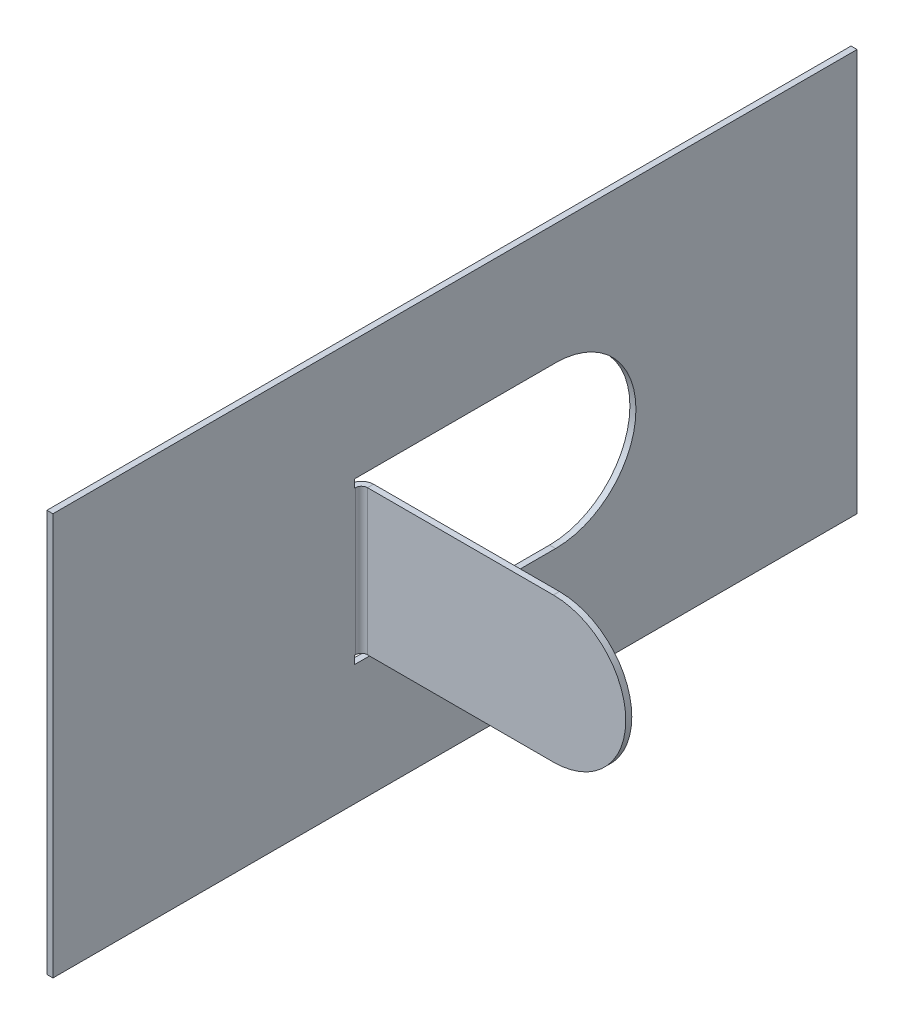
ISO-10303-21;
HEADER;
FILE_DESCRIPTION(('STEP AP214'),'2;1');
FILE_NAME('part.step','',(''),(''),'','','');
FILE_SCHEMA(('AUTOMOTIVE_DESIGN { 1 0 10303 214 1 1 1 1 }'));
ENDSEC;
DATA;
#1=APPLICATION_CONTEXT('core data for automotive mechanical design processes');
#2=APPLICATION_PROTOCOL_DEFINITION('international standard','automotive_design',2000,#1);
#3=PRODUCT_CONTEXT('',#1,'mechanical');
#4=PRODUCT('Part','Part','',(#3));
#5=PRODUCT_RELATED_PRODUCT_CATEGORY('part','',(#4));
#6=PRODUCT_DEFINITION_FORMATION('','',#4);
#7=PRODUCT_DEFINITION_CONTEXT('part definition',#1,'design');
#8=PRODUCT_DEFINITION('design','',#6,#7);
#9=PRODUCT_DEFINITION_SHAPE('','',#8);
#10=(LENGTH_UNIT() NAMED_UNIT(*) SI_UNIT(.MILLI.,.METRE.));
#11=(NAMED_UNIT(*) PLANE_ANGLE_UNIT() SI_UNIT($,.RADIAN.));
#12=(NAMED_UNIT(*) SI_UNIT($,.STERADIAN.) SOLID_ANGLE_UNIT());
#13=UNCERTAINTY_MEASURE_WITH_UNIT(LENGTH_MEASURE(1.E-05),#10,'distance_accuracy_value','');
#14=(GEOMETRIC_REPRESENTATION_CONTEXT(3) GLOBAL_UNCERTAINTY_ASSIGNED_CONTEXT((#13)) GLOBAL_UNIT_ASSIGNED_CONTEXT((#10,
#11,#12)) REPRESENTATION_CONTEXT('',''));
#15=CARTESIAN_POINT('',(0.,0.,0.));
#16=DIRECTION('',(0.,0.,1.));
#17=DIRECTION('',(1.,0.,0.));
#18=AXIS2_PLACEMENT_3D('',#15,#16,#17);
#19=CARTESIAN_POINT('',(-22.7328541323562,-50.,-123.267145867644));
#20=DIRECTION('',(1.,0.,0.));
#21=DIRECTION('',(0.,0.,-1.));
#22=AXIS2_PLACEMENT_3D('',#19,#20,#21);
#23=PLANE('',#22);
#24=DIRECTION('',(0.,1.,0.));
#25=VECTOR('',#24,1.);
#26=CARTESIAN_POINT('',(-22.7328541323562,50.,-123.267145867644));
#27=LINE('',#26,#25);
#28=CARTESIAN_POINT('',(-22.7328541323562,-50.,-123.267145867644));
#29=VERTEX_POINT('',#28);
#30=CARTESIAN_POINT('',(-22.7328541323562,50.,-123.267145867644));
#31=VERTEX_POINT('',#30);
#32=EDGE_CURVE('E247',#29,#31,#27,.T.);
#33=ORIENTED_EDGE('',*,*,#32,.T.);
#34=DIRECTION('',(0.,0.,1.));
#35=VECTOR('',#34,1.);
#36=CARTESIAN_POINT('',(-22.7328541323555,50.,76.7328541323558));
#37=LINE('',#36,#35);
#38=CARTESIAN_POINT('',(-22.7328541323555,50.,76.7328541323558));
#39=VERTEX_POINT('',#38);
#40=EDGE_CURVE('E274',#31,#39,#37,.T.);
#41=ORIENTED_EDGE('',*,*,#40,.T.);
#42=DIRECTION('',(0.,-1.,0.));
#43=VECTOR('',#42,1.);
#44=CARTESIAN_POINT('',(-22.7328541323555,50.,76.7328541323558));
#45=LINE('',#44,#43);
#46=CARTESIAN_POINT('',(-22.7328541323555,-50.,76.7328541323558));
#47=VERTEX_POINT('',#46);
#48=EDGE_CURVE('E277',#39,#47,#45,.T.);
#49=ORIENTED_EDGE('',*,*,#48,.T.);
#50=DIRECTION('',(0.,0.,-1.));
#51=VECTOR('',#50,1.);
#52=CARTESIAN_POINT('',(-22.7328541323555,-50.,76.7328541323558));
#53=LINE('',#52,#51);
#54=EDGE_CURVE('E262',#47,#29,#53,.T.);
#55=ORIENTED_EDGE('',*,*,#54,.T.);
#56=EDGE_LOOP('',(#33,#41,#49,#55));
#57=FACE_BOUND('',#56,.T.);
#58=DIRECTION('',(0.,0.,1.));
#59=VECTOR('',#58,1.);
#60=CARTESIAN_POINT('',(-22.7328541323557,-18.,1.73285413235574));
#61=LINE('',#60,#59);
#62=CARTESIAN_POINT('',(-22.7328541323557,-18.,1.5));
#63=VERTEX_POINT('',#62);
#64=CARTESIAN_POINT('',(-22.7328541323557,-18.,1.73285413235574));
#65=VERTEX_POINT('',#64);
#66=EDGE_CURVE('E58',#63,#65,#61,.T.);
#67=ORIENTED_EDGE('',*,*,#66,.F.);
#68=DIRECTION('',(0.,1.,0.));
#69=VECTOR('',#68,1.);
#70=CARTESIAN_POINT('',(-22.7328541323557,-50.,1.50000000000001));
#71=LINE('',#70,#69);
#72=CARTESIAN_POINT('',(-22.7328541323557,18.,1.5));
#73=VERTEX_POINT('',#72);
#74=EDGE_CURVE('E50',#63,#73,#71,.T.);
#75=ORIENTED_EDGE('',*,*,#74,.T.);
#76=DIRECTION('',(0.,0.,-1.));
#77=VECTOR('',#76,1.);
#78=CARTESIAN_POINT('',(-22.7328541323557,18.,1.73285413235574));
#79=LINE('',#78,#77);
#80=CARTESIAN_POINT('',(-22.7328541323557,18.,1.73285413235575));
#81=VERTEX_POINT('',#80);
#82=EDGE_CURVE('E66',#81,#73,#79,.T.);
#83=ORIENTED_EDGE('',*,*,#82,.F.);
#84=DIRECTION('',(0.,-1.,0.));
#85=VECTOR('',#84,1.);
#86=CARTESIAN_POINT('',(-22.7328541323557,20.,1.73285413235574));
#87=LINE('',#86,#85);
#88=CARTESIAN_POINT('',(-22.7328541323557,20.,1.73285413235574));
#89=VERTEX_POINT('',#88);
#90=EDGE_CURVE('E195',#89,#81,#87,.T.);
#91=ORIENTED_EDGE('',*,*,#90,.F.);
#92=DIRECTION('',(0.,0.,1.));
#93=VECTOR('',#92,1.);
#94=CARTESIAN_POINT('',(-22.7328541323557,20.,1.73285413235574));
#95=LINE('',#94,#93);
#96=CARTESIAN_POINT('',(-22.7328541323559,19.9999999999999,-48.2671458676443));
#97=VERTEX_POINT('',#96);
#98=EDGE_CURVE('E219',#97,#89,#95,.T.);
#99=ORIENTED_EDGE('',*,*,#98,.F.);
#100=CARTESIAN_POINT('',(-22.7328541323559,0.,-48.2671458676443));
#101=DIRECTION('',(1.,0.,0.));
#102=DIRECTION('',(0.,0.,-1.));
#103=AXIS2_PLACEMENT_3D('',#100,#101,#102);
#104=CIRCLE('',#103,20.);
#105=CARTESIAN_POINT('',(-22.7328541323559,-20.,-48.2671458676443));
#106=VERTEX_POINT('',#105);
#107=EDGE_CURVE('E240',#106,#97,#104,.T.);
#108=ORIENTED_EDGE('',*,*,#107,.F.);
#109=DIRECTION('',(0.,0.,-1.));
#110=VECTOR('',#109,1.);
#111=CARTESIAN_POINT('',(-22.7328541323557,-20.,1.73285413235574));
#112=LINE('',#111,#110);
#113=CARTESIAN_POINT('',(-22.7328541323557,-20.,1.73285413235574));
#114=VERTEX_POINT('',#113);
#115=EDGE_CURVE('E237',#114,#106,#112,.T.);
#116=ORIENTED_EDGE('',*,*,#115,.F.);
#117=DIRECTION('',(0.,-1.,0.));
#118=VECTOR('',#117,1.);
#119=CARTESIAN_POINT('',(-22.7328541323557,-18.,1.73285413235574));
#120=LINE('',#119,#118);
#121=EDGE_CURVE('E234',#65,#114,#120,.T.);
#122=ORIENTED_EDGE('',*,*,#121,.F.);
#123=EDGE_LOOP('',(#67,#75,#83,#91,#99,#108,#116,#122));
#124=FACE_BOUND('',#123,.T.);
#125=ADVANCED_FACE('F41',(#57,#124),#23,.T.);
#126=CARTESIAN_POINT('',(-24.2328541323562,50.,-123.267145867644));
#127=DIRECTION('',(0.,0.,-1.));
#128=DIRECTION('',(-1.,0.,0.));
#129=AXIS2_PLACEMENT_3D('',#126,#127,#128);
#130=PLANE('',#129);
#131=ORIENTED_EDGE('',*,*,#32,.F.);
#132=DIRECTION('',(1.,0.,0.));
#133=VECTOR('',#132,1.);
#134=CARTESIAN_POINT('',(-24.2328541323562,-50.,-123.267145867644));
#135=LINE('',#134,#133);
#136=CARTESIAN_POINT('',(-24.2328541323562,-50.,-123.267145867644));
#137=VERTEX_POINT('',#136);
#138=EDGE_CURVE('E282',#137,#29,#135,.T.);
#139=ORIENTED_EDGE('',*,*,#138,.F.);
#140=DIRECTION('',(0.,1.,0.));
#141=VECTOR('',#140,1.);
#142=CARTESIAN_POINT('',(-24.2328541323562,50.,-123.267145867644));
#143=LINE('',#142,#141);
#144=CARTESIAN_POINT('',(-24.2328541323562,50.,-123.267145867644));
#145=VERTEX_POINT('',#144);
#146=EDGE_CURVE('E258',#137,#145,#143,.T.);
#147=ORIENTED_EDGE('',*,*,#146,.T.);
#148=DIRECTION('',(1.,0.,0.));
#149=VECTOR('',#148,1.);
#150=CARTESIAN_POINT('',(-24.2328541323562,50.,-123.267145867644));
#151=LINE('',#150,#149);
#152=EDGE_CURVE('E271',#145,#31,#151,.T.);
#153=ORIENTED_EDGE('',*,*,#152,.T.);
#154=EDGE_LOOP('',(#131,#139,#147,#153));
#155=FACE_BOUND('',#154,.T.);
#156=ADVANCED_FACE('F353',(#155),#130,.T.);
#157=CARTESIAN_POINT('',(-24.2328541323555,-50.,76.7328541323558));
#158=DIRECTION('',(0.,-1.,0.));
#159=DIRECTION('',(-1.,0.,0.));
#160=AXIS2_PLACEMENT_3D('',#157,#158,#159);
#161=PLANE('',#160);
#162=ORIENTED_EDGE('',*,*,#54,.F.);
#163=DIRECTION('',(1.,0.,0.));
#164=VECTOR('',#163,1.);
#165=CARTESIAN_POINT('',(-24.2328541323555,-50.,76.7328541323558));
#166=LINE('',#165,#164);
#167=CARTESIAN_POINT('',(-24.2328541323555,-50.,76.7328541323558));
#168=VERTEX_POINT('',#167);
#169=EDGE_CURVE('E285',#168,#47,#166,.T.);
#170=ORIENTED_EDGE('',*,*,#169,.F.);
#171=DIRECTION('',(0.,0.,-1.));
#172=VECTOR('',#171,1.);
#173=CARTESIAN_POINT('',(-24.2328541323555,-50.,76.7328541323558));
#174=LINE('',#173,#172);
#175=EDGE_CURVE('E268',#168,#137,#174,.T.);
#176=ORIENTED_EDGE('',*,*,#175,.T.);
#177=ORIENTED_EDGE('',*,*,#138,.T.);
#178=EDGE_LOOP('',(#162,#170,#176,#177));
#179=FACE_BOUND('',#178,.T.);
#180=ADVANCED_FACE('F358',(#179),#161,.T.);
#181=CARTESIAN_POINT('',(-24.2328541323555,50.,76.7328541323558));
#182=DIRECTION('',(0.,0.,1.));
#183=DIRECTION('',(0.,-1.,0.));
#184=AXIS2_PLACEMENT_3D('',#181,#182,#183);
#185=PLANE('',#184);
#186=ORIENTED_EDGE('',*,*,#48,.F.);
#187=DIRECTION('',(1.,0.,0.));
#188=VECTOR('',#187,1.);
#189=CARTESIAN_POINT('',(-24.2328541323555,50.,76.7328541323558));
#190=LINE('',#189,#188);
#191=CARTESIAN_POINT('',(-24.2328541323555,50.,76.7328541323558));
#192=VERTEX_POINT('',#191);
#193=EDGE_CURVE('E287',#192,#39,#190,.T.);
#194=ORIENTED_EDGE('',*,*,#193,.F.);
#195=DIRECTION('',(0.,-1.,0.));
#196=VECTOR('',#195,1.);
#197=CARTESIAN_POINT('',(-24.2328541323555,50.,76.7328541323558));
#198=LINE('',#197,#196);
#199=EDGE_CURVE('E265',#192,#168,#198,.T.);
#200=ORIENTED_EDGE('',*,*,#199,.T.);
#201=ORIENTED_EDGE('',*,*,#169,.T.);
#202=EDGE_LOOP('',(#186,#194,#200,#201));
#203=FACE_BOUND('',#202,.T.);
#204=ADVANCED_FACE('F367',(#203),#185,.T.);
#205=CARTESIAN_POINT('',(-24.2328541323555,50.,76.7328541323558));
#206=DIRECTION('',(0.,1.,0.));
#207=DIRECTION('',(1.,0.,0.));
#208=AXIS2_PLACEMENT_3D('',#205,#206,#207);
#209=PLANE('',#208);
#210=ORIENTED_EDGE('',*,*,#40,.F.);
#211=ORIENTED_EDGE('',*,*,#152,.F.);
#212=DIRECTION('',(0.,0.,1.));
#213=VECTOR('',#212,1.);
#214=CARTESIAN_POINT('',(-24.2328541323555,50.,76.7328541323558));
#215=LINE('',#214,#213);
#216=EDGE_CURVE('E261',#145,#192,#215,.T.);
#217=ORIENTED_EDGE('',*,*,#216,.T.);
#218=ORIENTED_EDGE('',*,*,#193,.T.);
#219=EDGE_LOOP('',(#210,#211,#217,#218));
#220=FACE_BOUND('',#219,.T.);
#221=ADVANCED_FACE('F363',(#220),#209,.T.);
#222=CARTESIAN_POINT('',(-24.2328541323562,-50.,-123.267145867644));
#223=DIRECTION('',(1.,0.,0.));
#224=DIRECTION('',(0.,0.,-1.));
#225=AXIS2_PLACEMENT_3D('',#222,#223,#224);
#226=PLANE('',#225);
#227=DIRECTION('',(0.,1.,0.));
#228=VECTOR('',#227,1.);
#229=CARTESIAN_POINT('',(-24.2328541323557,-50.,1.50000000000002));
#230=LINE('',#229,#228);
#231=CARTESIAN_POINT('',(-24.2328541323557,-18.,1.50000000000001));
#232=VERTEX_POINT('',#231);
#233=CARTESIAN_POINT('',(-24.2328541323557,18.,1.50000000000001));
#234=VERTEX_POINT('',#233);
#235=EDGE_CURVE('E284',#232,#234,#230,.T.);
#236=ORIENTED_EDGE('',*,*,#235,.F.);
#237=DIRECTION('',(0.,0.,1.));
#238=VECTOR('',#237,1.);
#239=CARTESIAN_POINT('',(-24.2328541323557,-18.,1.73285413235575));
#240=LINE('',#239,#238);
#241=CARTESIAN_POINT('',(-24.2328541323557,-18.,1.73285413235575));
#242=VERTEX_POINT('',#241);
#243=EDGE_CURVE('E45',#232,#242,#240,.T.);
#244=ORIENTED_EDGE('',*,*,#243,.T.);
#245=DIRECTION('',(0.,-1.,0.));
#246=VECTOR('',#245,1.);
#247=CARTESIAN_POINT('',(-24.2328541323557,-18.,1.73285413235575));
#248=LINE('',#247,#246);
#249=CARTESIAN_POINT('',(-24.2328541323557,-20.,1.73285413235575));
#250=VERTEX_POINT('',#249);
#251=EDGE_CURVE('E220',#242,#250,#248,.T.);
#252=ORIENTED_EDGE('',*,*,#251,.T.);
#253=DIRECTION('',(0.,0.,-1.));
#254=VECTOR('',#253,1.);
#255=CARTESIAN_POINT('',(-24.2328541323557,-20.,1.73285413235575));
#256=LINE('',#255,#254);
#257=CARTESIAN_POINT('',(-24.2328541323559,-20.,-48.2671458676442));
#258=VERTEX_POINT('',#257);
#259=EDGE_CURVE('E223',#250,#258,#256,.T.);
#260=ORIENTED_EDGE('',*,*,#259,.T.);
#261=CARTESIAN_POINT('',(-24.2328541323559,0.,-48.2671458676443));
#262=DIRECTION('',(1.,0.,0.));
#263=DIRECTION('',(0.,0.,-1.));
#264=AXIS2_PLACEMENT_3D('',#261,#262,#263);
#265=CIRCLE('',#264,20.);
#266=CARTESIAN_POINT('',(-24.2328541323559,19.9999999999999,-48.2671458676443));
#267=VERTEX_POINT('',#266);
#268=EDGE_CURVE('E226',#258,#267,#265,.T.);
#269=ORIENTED_EDGE('',*,*,#268,.T.);
#270=DIRECTION('',(0.,0.,1.));
#271=VECTOR('',#270,1.);
#272=CARTESIAN_POINT('',(-24.2328541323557,20.,1.73285413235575));
#273=LINE('',#272,#271);
#274=CARTESIAN_POINT('',(-24.2328541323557,20.,1.73285413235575));
#275=VERTEX_POINT('',#274);
#276=EDGE_CURVE('E229',#267,#275,#273,.T.);
#277=ORIENTED_EDGE('',*,*,#276,.T.);
#278=DIRECTION('',(0.,-1.,0.));
#279=VECTOR('',#278,1.);
#280=CARTESIAN_POINT('',(-24.2328541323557,20.,1.73285413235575));
#281=LINE('',#280,#279);
#282=CARTESIAN_POINT('',(-24.2328541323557,18.,1.73285413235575));
#283=VERTEX_POINT('',#282);
#284=EDGE_CURVE('E215',#275,#283,#281,.T.);
#285=ORIENTED_EDGE('',*,*,#284,.T.);
#286=DIRECTION('',(0.,0.,-1.));
#287=VECTOR('',#286,1.);
#288=CARTESIAN_POINT('',(-24.2328541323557,18.,1.73285413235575));
#289=LINE('',#288,#287);
#290=EDGE_CURVE('E218',#283,#234,#289,.T.);
#291=ORIENTED_EDGE('',*,*,#290,.T.);
#292=EDGE_LOOP('',(#236,#244,#252,#260,#269,#277,#285,#291));
#293=FACE_BOUND('',#292,.T.);
#294=ORIENTED_EDGE('',*,*,#146,.F.);
#295=ORIENTED_EDGE('',*,*,#175,.F.);
#296=ORIENTED_EDGE('',*,*,#199,.F.);
#297=ORIENTED_EDGE('',*,*,#216,.F.);
#298=EDGE_LOOP('',(#294,#295,#296,#297));
#299=FACE_BOUND('',#298,.T.);
#300=ADVANCED_FACE('F301',(#293,#299),#226,.F.);
#301=CARTESIAN_POINT('',(-24.2328541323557,20.,1.73285413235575));
#302=DIRECTION('',(0.,0.,1.));
#303=DIRECTION('',(1.,0.,0.));
#304=AXIS2_PLACEMENT_3D('',#301,#302,#303);
#305=PLANE('',#304);
#306=ORIENTED_EDGE('',*,*,#90,.T.);
#307=DIRECTION('',(1.,0.,0.));
#308=VECTOR('',#307,1.);
#309=CARTESIAN_POINT('',(-24.2328541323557,18.,1.73285413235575));
#310=LINE('',#309,#308);
#311=EDGE_CURVE('E232',#283,#81,#310,.T.);
#312=ORIENTED_EDGE('',*,*,#311,.F.);
#313=ORIENTED_EDGE('',*,*,#284,.F.);
#314=DIRECTION('',(1.,0.,0.));
#315=VECTOR('',#314,1.);
#316=CARTESIAN_POINT('',(-24.2328541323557,20.,1.73285413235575));
#317=LINE('',#316,#315);
#318=EDGE_CURVE('E245',#275,#89,#317,.T.);
#319=ORIENTED_EDGE('',*,*,#318,.T.);
#320=EDGE_LOOP('',(#306,#312,#313,#319));
#321=FACE_BOUND('',#320,.T.);
#322=ADVANCED_FACE('F322',(#321),#305,.F.);
#323=CARTESIAN_POINT('',(-24.2328541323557,20.,1.73285413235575));
#324=DIRECTION('',(0.,1.,0.));
#325=DIRECTION('',(1.,0.,0.));
#326=AXIS2_PLACEMENT_3D('',#323,#324,#325);
#327=PLANE('',#326);
#328=ORIENTED_EDGE('',*,*,#98,.T.);
#329=ORIENTED_EDGE('',*,*,#318,.F.);
#330=ORIENTED_EDGE('',*,*,#276,.F.);
#331=DIRECTION('',(1.,0.,0.));
#332=VECTOR('',#331,1.);
#333=CARTESIAN_POINT('',(-24.2328541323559,19.9999999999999,-48.2671458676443));
#334=LINE('',#333,#332);
#335=EDGE_CURVE('E248',#267,#97,#334,.T.);
#336=ORIENTED_EDGE('',*,*,#335,.T.);
#337=EDGE_LOOP('',(#328,#329,#330,#336));
#338=FACE_BOUND('',#337,.T.);
#339=ADVANCED_FACE('F318',(#338),#327,.F.);
#340=CARTESIAN_POINT('',(-24.2328541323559,0.,-48.2671458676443));
#341=DIRECTION('',(1.,0.,0.));
#342=DIRECTION('',(0.,0.,-1.));
#343=AXIS2_PLACEMENT_3D('',#340,#341,#342);
#344=CYLINDRICAL_SURFACE('',#343,20.);
#345=ORIENTED_EDGE('',*,*,#107,.T.);
#346=ORIENTED_EDGE('',*,*,#335,.F.);
#347=ORIENTED_EDGE('',*,*,#268,.F.);
#348=DIRECTION('',(1.,0.,0.));
#349=VECTOR('',#348,1.);
#350=CARTESIAN_POINT('',(-24.2328541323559,-20.,-48.2671458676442));
#351=LINE('',#350,#349);
#352=EDGE_CURVE('E250',#258,#106,#351,.T.);
#353=ORIENTED_EDGE('',*,*,#352,.T.);
#354=EDGE_LOOP('',(#345,#346,#347,#353));
#355=FACE_BOUND('',#354,.T.);
#356=ADVANCED_FACE('F314',(#355),#344,.F.);
#357=CARTESIAN_POINT('',(-24.2328541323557,-20.,1.73285413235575));
#358=DIRECTION('',(0.,-1.,0.));
#359=DIRECTION('',(0.,0.,-1.));
#360=AXIS2_PLACEMENT_3D('',#357,#358,#359);
#361=PLANE('',#360);
#362=ORIENTED_EDGE('',*,*,#115,.T.);
#363=ORIENTED_EDGE('',*,*,#352,.F.);
#364=ORIENTED_EDGE('',*,*,#259,.F.);
#365=DIRECTION('',(1.,0.,0.));
#366=VECTOR('',#365,1.);
#367=CARTESIAN_POINT('',(-24.2328541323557,-20.,1.73285413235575));
#368=LINE('',#367,#366);
#369=EDGE_CURVE('E252',#250,#114,#368,.T.);
#370=ORIENTED_EDGE('',*,*,#369,.T.);
#371=EDGE_LOOP('',(#362,#363,#364,#370));
#372=FACE_BOUND('',#371,.T.);
#373=ADVANCED_FACE('F310',(#372),#361,.F.);
#374=CARTESIAN_POINT('',(-24.2328541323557,-18.,1.73285413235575));
#375=DIRECTION('',(0.,0.,1.));
#376=DIRECTION('',(1.,0.,0.));
#377=AXIS2_PLACEMENT_3D('',#374,#375,#376);
#378=PLANE('',#377);
#379=ORIENTED_EDGE('',*,*,#121,.T.);
#380=ORIENTED_EDGE('',*,*,#369,.F.);
#381=ORIENTED_EDGE('',*,*,#251,.F.);
#382=DIRECTION('',(1.,0.,0.));
#383=VECTOR('',#382,1.);
#384=CARTESIAN_POINT('',(-24.2328541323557,-18.,1.73285413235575));
#385=LINE('',#384,#383);
#386=EDGE_CURVE('E254',#242,#65,#385,.T.);
#387=ORIENTED_EDGE('',*,*,#386,.T.);
#388=EDGE_LOOP('',(#379,#380,#381,#387));
#389=FACE_BOUND('',#388,.T.);
#390=ADVANCED_FACE('F306',(#389),#378,.F.);
#391=CARTESIAN_POINT('',(-24.2328541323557,-18.,1.73285413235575));
#392=DIRECTION('',(0.,1.,0.));
#393=DIRECTION('',(0.,0.,1.));
#394=AXIS2_PLACEMENT_3D('',#391,#392,#393);
#395=PLANE('',#394);
#396=DIRECTION('',(-1.,0.,0.));
#397=VECTOR('',#396,1.);
#398=CARTESIAN_POINT('',(-24.2328541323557,-18.,1.50000000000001));
#399=LINE('',#398,#397);
#400=EDGE_CURVE('E12',#63,#232,#399,.T.);
#401=ORIENTED_EDGE('',*,*,#400,.F.);
#402=ORIENTED_EDGE('',*,*,#66,.T.);
#403=ORIENTED_EDGE('',*,*,#386,.F.);
#404=ORIENTED_EDGE('',*,*,#243,.F.);
#405=EDGE_LOOP('',(#401,#402,#403,#404));
#406=FACE_BOUND('',#405,.T.);
#407=ADVANCED_FACE('F43',(#406),#395,.F.);
#408=CARTESIAN_POINT('',(-24.2328541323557,18.,1.73285413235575));
#409=DIRECTION('',(0.,-1.,0.));
#410=DIRECTION('',(0.,0.,-1.));
#411=AXIS2_PLACEMENT_3D('',#408,#409,#410);
#412=PLANE('',#411);
#413=DIRECTION('',(1.,0.,0.));
#414=VECTOR('',#413,1.);
#415=CARTESIAN_POINT('',(-24.2328541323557,18.,1.50000000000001));
#416=LINE('',#415,#414);
#417=EDGE_CURVE('E291',#234,#73,#416,.T.);
#418=ORIENTED_EDGE('',*,*,#417,.F.);
#419=ORIENTED_EDGE('',*,*,#290,.F.);
#420=ORIENTED_EDGE('',*,*,#311,.T.);
#421=ORIENTED_EDGE('',*,*,#82,.T.);
#422=EDGE_LOOP('',(#418,#419,#420,#421));
#423=FACE_BOUND('',#422,.T.);
#424=ADVANCED_FACE('F323',(#423),#412,.F.);
#425=CARTESIAN_POINT('',(25.,0.,-1.5));
#426=DIRECTION('',(0.,0.,1.));
#427=DIRECTION('',(1.,0.,0.));
#428=AXIS2_PLACEMENT_3D('',#425,#426,#427);
#429=CYLINDRICAL_SURFACE('',#428,18.);
#430=CARTESIAN_POINT('',(25.,0.,0.));
#431=DIRECTION('',(0.,0.,-1.));
#432=DIRECTION('',(1.,0.,0.));
#433=AXIS2_PLACEMENT_3D('',#430,#431,#432);
#434=CIRCLE('',#433,18.);
#435=CARTESIAN_POINT('',(25.,18.,0.));
#436=VERTEX_POINT('',#435);
#437=CARTESIAN_POINT('',(25.,-18.,0.));
#438=VERTEX_POINT('',#437);
#439=EDGE_CURVE('E210',#436,#438,#434,.T.);
#440=ORIENTED_EDGE('',*,*,#439,.T.);
#441=DIRECTION('',(0.,0.,1.));
#442=VECTOR('',#441,1.);
#443=CARTESIAN_POINT('',(25.,-18.,-1.5));
#444=LINE('',#443,#442);
#445=CARTESIAN_POINT('',(25.,-18.,-1.5));
#446=VERTEX_POINT('',#445);
#447=EDGE_CURVE('E193',#446,#438,#444,.T.);
#448=ORIENTED_EDGE('',*,*,#447,.F.);
#449=CARTESIAN_POINT('',(25.,0.,-1.5));
#450=DIRECTION('',(0.,0.,-1.));
#451=DIRECTION('',(1.,0.,0.));
#452=AXIS2_PLACEMENT_3D('',#449,#450,#451);
#453=CIRCLE('',#452,18.);
#454=CARTESIAN_POINT('',(25.,18.,-1.5));
#455=VERTEX_POINT('',#454);
#456=EDGE_CURVE('E183',#455,#446,#453,.T.);
#457=ORIENTED_EDGE('',*,*,#456,.F.);
#458=DIRECTION('',(0.,0.,1.));
#459=VECTOR('',#458,1.);
#460=CARTESIAN_POINT('',(25.,18.,-1.5));
#461=LINE('',#460,#459);
#462=EDGE_CURVE('E186',#455,#436,#461,.T.);
#463=ORIENTED_EDGE('',*,*,#462,.T.);
#464=EDGE_LOOP('',(#440,#448,#457,#463));
#465=FACE_BOUND('',#464,.T.);
#466=ADVANCED_FACE('F342',(#465),#429,.T.);
#467=CARTESIAN_POINT('',(100.,-50.,-1.5));
#468=DIRECTION('',(0.,0.,1.));
#469=DIRECTION('',(1.,0.,0.));
#470=AXIS2_PLACEMENT_3D('',#467,#468,#469);
#471=PLANE('',#470);
#472=DIRECTION('',(-1.,0.,0.));
#473=VECTOR('',#472,1.);
#474=CARTESIAN_POINT('',(-25.,-18.,-1.5));
#475=LINE('',#474,#473);
#476=CARTESIAN_POINT('',(-21.2328541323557,-18.,-1.5));
#477=VERTEX_POINT('',#476);
#478=EDGE_CURVE('E177',#446,#477,#475,.T.);
#479=ORIENTED_EDGE('',*,*,#478,.T.);
#480=DIRECTION('',(0.,1.,0.));
#481=VECTOR('',#480,1.);
#482=CARTESIAN_POINT('',(-21.2328541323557,-50.,-1.5));
#483=LINE('',#482,#481);
#484=CARTESIAN_POINT('',(-21.2328541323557,18.,-1.5));
#485=VERTEX_POINT('',#484);
#486=EDGE_CURVE('E170',#477,#485,#483,.T.);
#487=ORIENTED_EDGE('',*,*,#486,.T.);
#488=DIRECTION('',(1.,0.,0.));
#489=VECTOR('',#488,1.);
#490=CARTESIAN_POINT('',(-25.,18.,-1.5));
#491=LINE('',#490,#489);
#492=EDGE_CURVE('E176',#485,#455,#491,.T.);
#493=ORIENTED_EDGE('',*,*,#492,.T.);
#494=ORIENTED_EDGE('',*,*,#456,.T.);
#495=EDGE_LOOP('',(#479,#487,#493,#494));
#496=FACE_BOUND('',#495,.T.);
#497=ADVANCED_FACE('F181',(#496),#471,.F.);
#498=CARTESIAN_POINT('',(-25.,18.,-1.5));
#499=DIRECTION('',(0.,-1.,0.));
#500=DIRECTION('',(1.,0.,0.));
#501=AXIS2_PLACEMENT_3D('',#498,#499,#500);
#502=PLANE('',#501);
#503=ORIENTED_EDGE('',*,*,#492,.F.);
#504=DIRECTION('',(0.,0.,1.));
#505=VECTOR('',#504,1.);
#506=CARTESIAN_POINT('',(-21.2328541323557,18.,-1.5));
#507=LINE('',#506,#505);
#508=CARTESIAN_POINT('',(-21.2328541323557,18.,0.));
#509=VERTEX_POINT('',#508);
#510=EDGE_CURVE('E203',#485,#509,#507,.T.);
#511=ORIENTED_EDGE('',*,*,#510,.T.);
#512=DIRECTION('',(1.,0.,0.));
#513=VECTOR('',#512,1.);
#514=CARTESIAN_POINT('',(-25.,18.,0.));
#515=LINE('',#514,#513);
#516=EDGE_CURVE('E198',#509,#436,#515,.T.);
#517=ORIENTED_EDGE('',*,*,#516,.T.);
#518=ORIENTED_EDGE('',*,*,#462,.F.);
#519=EDGE_LOOP('',(#503,#511,#517,#518));
#520=FACE_BOUND('',#519,.T.);
#521=ADVANCED_FACE('F340',(#520),#502,.F.);
#522=CARTESIAN_POINT('',(100.,-50.,0.));
#523=DIRECTION('',(0.,0.,1.));
#524=DIRECTION('',(1.,0.,0.));
#525=AXIS2_PLACEMENT_3D('',#522,#523,#524);
#526=PLANE('',#525);
#527=DIRECTION('',(0.,1.,0.));
#528=VECTOR('',#527,1.);
#529=CARTESIAN_POINT('',(-21.2328541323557,-50.,0.));
#530=LINE('',#529,#528);
#531=CARTESIAN_POINT('',(-21.2328541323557,-18.,0.));
#532=VERTEX_POINT('',#531);
#533=EDGE_CURVE('E213',#532,#509,#530,.T.);
#534=ORIENTED_EDGE('',*,*,#533,.F.);
#535=DIRECTION('',(-1.,0.,0.));
#536=VECTOR('',#535,1.);
#537=CARTESIAN_POINT('',(-25.,-18.,0.));
#538=LINE('',#537,#536);
#539=EDGE_CURVE('E191',#438,#532,#538,.T.);
#540=ORIENTED_EDGE('',*,*,#539,.F.);
#541=ORIENTED_EDGE('',*,*,#439,.F.);
#542=ORIENTED_EDGE('',*,*,#516,.F.);
#543=EDGE_LOOP('',(#534,#540,#541,#542));
#544=FACE_BOUND('',#543,.T.);
#545=ADVANCED_FACE('F336',(#544),#526,.T.);
#546=CARTESIAN_POINT('',(-25.,-18.,-1.5));
#547=DIRECTION('',(0.,1.,0.));
#548=DIRECTION('',(-1.,0.,0.));
#549=AXIS2_PLACEMENT_3D('',#546,#547,#548);
#550=PLANE('',#549);
#551=ORIENTED_EDGE('',*,*,#539,.T.);
#552=DIRECTION('',(0.,0.,-1.));
#553=VECTOR('',#552,1.);
#554=CARTESIAN_POINT('',(-21.2328541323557,-18.,-1.5));
#555=LINE('',#554,#553);
#556=EDGE_CURVE('E161',#532,#477,#555,.T.);
#557=ORIENTED_EDGE('',*,*,#556,.T.);
#558=ORIENTED_EDGE('',*,*,#478,.F.);
#559=ORIENTED_EDGE('',*,*,#447,.T.);
#560=EDGE_LOOP('',(#551,#557,#558,#559));
#561=FACE_BOUND('',#560,.T.);
#562=ADVANCED_FACE('F189',(#561),#550,.F.);
#563=CARTESIAN_POINT('',(-21.2328541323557,-18.,1.5));
#564=DIRECTION('',(0.,-1.,0.));
#565=DIRECTION('',(0.,0.,-1.));
#566=AXIS2_PLACEMENT_3D('',#563,#564,#565);
#567=PLANE('',#566);
#568=ORIENTED_EDGE('',*,*,#556,.F.);
#569=CARTESIAN_POINT('',(-21.2328541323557,-18.,1.5));
#570=DIRECTION('',(0.,1.,0.));
#571=DIRECTION('',(0.,0.,1.));
#572=AXIS2_PLACEMENT_3D('',#569,#570,#571);
#573=CIRCLE('',#572,1.5);
#574=EDGE_CURVE('E332',#532,#63,#573,.T.);
#575=ORIENTED_EDGE('',*,*,#574,.T.);
#576=ORIENTED_EDGE('',*,*,#400,.T.);
#577=CARTESIAN_POINT('',(-21.2328541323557,-18.,1.5));
#578=DIRECTION('',(0.,1.,0.));
#579=DIRECTION('',(0.,0.,1.));
#580=AXIS2_PLACEMENT_3D('',#577,#578,#579);
#581=CIRCLE('',#580,3.);
#582=EDGE_CURVE('E156',#477,#232,#581,.T.);
#583=ORIENTED_EDGE('',*,*,#582,.F.);
#584=EDGE_LOOP('',(#568,#575,#576,#583));
#585=FACE_BOUND('',#584,.T.);
#586=ADVANCED_FACE('F158',(#585),#567,.T.);
#587=CARTESIAN_POINT('',(-21.2328541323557,18.,1.5));
#588=DIRECTION('',(0.,1.,0.));
#589=DIRECTION('',(0.,0.,1.));
#590=AXIS2_PLACEMENT_3D('',#587,#588,#589);
#591=PLANE('',#590);
#592=ORIENTED_EDGE('',*,*,#417,.T.);
#593=CARTESIAN_POINT('',(-21.2328541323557,18.,1.5));
#594=DIRECTION('',(0.,1.,0.));
#595=DIRECTION('',(0.,0.,1.));
#596=AXIS2_PLACEMENT_3D('',#593,#594,#595);
#597=CIRCLE('',#596,1.5);
#598=EDGE_CURVE('E166',#73,#509,#597,.F.);
#599=ORIENTED_EDGE('',*,*,#598,.T.);
#600=ORIENTED_EDGE('',*,*,#510,.F.);
#601=CARTESIAN_POINT('',(-21.2328541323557,18.,1.5));
#602=DIRECTION('',(0.,-1.,0.));
#603=DIRECTION('',(0.,0.,-1.));
#604=AXIS2_PLACEMENT_3D('',#601,#602,#603);
#605=CIRCLE('',#604,3.);
#606=EDGE_CURVE('E165',#234,#485,#605,.T.);
#607=ORIENTED_EDGE('',*,*,#606,.F.);
#608=EDGE_LOOP('',(#592,#599,#600,#607));
#609=FACE_BOUND('',#608,.T.);
#610=ADVANCED_FACE('F327',(#609),#591,.T.);
#611=CARTESIAN_POINT('',(-21.2328541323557,-36.2041602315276,1.5));
#612=DIRECTION('',(0.,1.,0.));
#613=DIRECTION('',(0.,0.,1.));
#614=AXIS2_PLACEMENT_3D('',#611,#612,#613);
#615=CYLINDRICAL_SURFACE('',#614,3.);
#616=ORIENTED_EDGE('',*,*,#606,.T.);
#617=ORIENTED_EDGE('',*,*,#486,.F.);
#618=ORIENTED_EDGE('',*,*,#582,.T.);
#619=ORIENTED_EDGE('',*,*,#235,.T.);
#620=EDGE_LOOP('',(#616,#617,#618,#619));
#621=FACE_BOUND('',#620,.T.);
#622=ADVANCED_FACE('F172',(#621),#615,.T.);
#623=CARTESIAN_POINT('',(-21.2328541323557,-36.2041602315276,1.5));
#624=DIRECTION('',(0.,1.,0.));
#625=DIRECTION('',(0.,0.,1.));
#626=AXIS2_PLACEMENT_3D('',#623,#624,#625);
#627=CYLINDRICAL_SURFACE('',#626,1.5);
#628=ORIENTED_EDGE('',*,*,#598,.F.);
#629=ORIENTED_EDGE('',*,*,#74,.F.);
#630=ORIENTED_EDGE('',*,*,#574,.F.);
#631=ORIENTED_EDGE('',*,*,#533,.T.);
#632=EDGE_LOOP('',(#628,#629,#630,#631));
#633=FACE_BOUND('',#632,.T.);
#634=ADVANCED_FACE('F331',(#633),#627,.F.);
#635=CLOSED_SHELL('',(#125,#156,#180,#204,#221,#300,#322,#339,#356,#373,#390,#407,#424,#466,
#497,#521,#545,#562,#586,#610,#622,#634));
#636=MANIFOLD_SOLID_BREP('B2',#635);
#637=ADVANCED_BREP_SHAPE_REPRESENTATION('',(#18,#636),#14);
#638=SHAPE_DEFINITION_REPRESENTATION(#9,#637);
ENDSEC;
END-ISO-10303-21;
